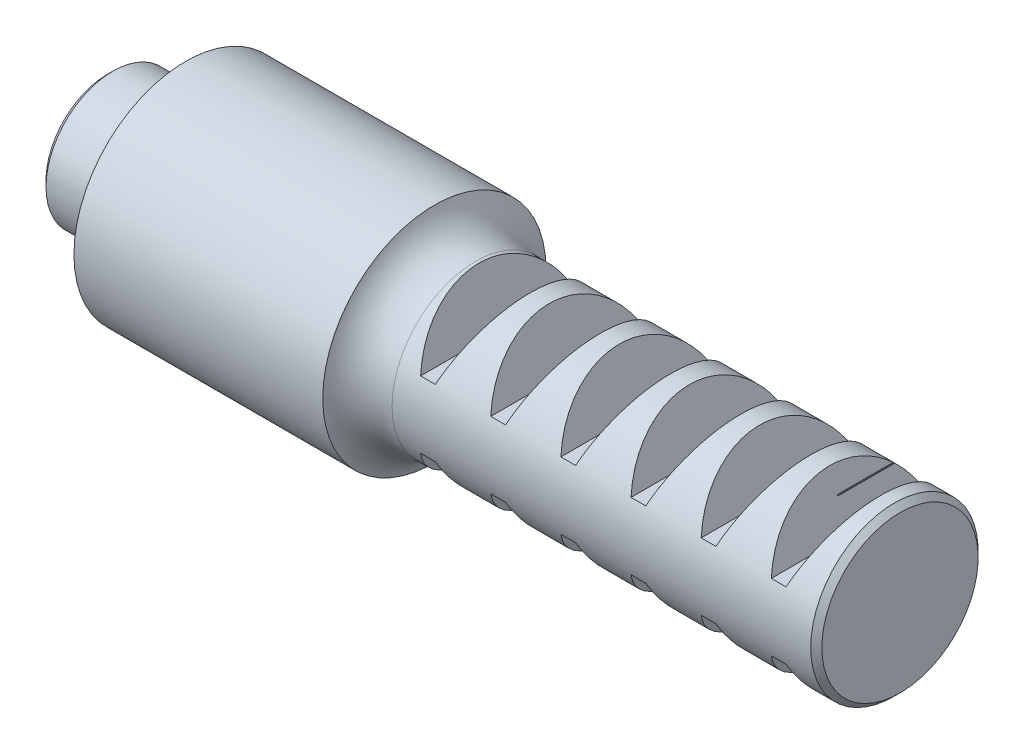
ISO-10303-21;
HEADER;
FILE_DESCRIPTION(('STEP AP214'),'2;1');
FILE_NAME('part.step','',(''),(''),'','','');
FILE_SCHEMA(('AUTOMOTIVE_DESIGN { 1 0 10303 214 1 1 1 1 }'));
ENDSEC;
DATA;
#1=APPLICATION_CONTEXT('core data for automotive mechanical design processes');
#2=APPLICATION_PROTOCOL_DEFINITION('international standard','automotive_design',2000,#1);
#3=PRODUCT_CONTEXT('',#1,'mechanical');
#4=PRODUCT('Part','Part','',(#3));
#5=PRODUCT_RELATED_PRODUCT_CATEGORY('part','',(#4));
#6=PRODUCT_DEFINITION_FORMATION('','',#4);
#7=PRODUCT_DEFINITION_CONTEXT('part definition',#1,'design');
#8=PRODUCT_DEFINITION('design','',#6,#7);
#9=PRODUCT_DEFINITION_SHAPE('','',#8);
#10=(LENGTH_UNIT() NAMED_UNIT(*) SI_UNIT(.MILLI.,.METRE.));
#11=(NAMED_UNIT(*) PLANE_ANGLE_UNIT() SI_UNIT($,.RADIAN.));
#12=(NAMED_UNIT(*) SI_UNIT($,.STERADIAN.) SOLID_ANGLE_UNIT());
#13=UNCERTAINTY_MEASURE_WITH_UNIT(LENGTH_MEASURE(1.E-05),#10,'distance_accuracy_value','');
#14=(GEOMETRIC_REPRESENTATION_CONTEXT(3) GLOBAL_UNCERTAINTY_ASSIGNED_CONTEXT((#13)) GLOBAL_UNIT_ASSIGNED_CONTEXT((#10,
#11,#12)) REPRESENTATION_CONTEXT('',''));
#15=CARTESIAN_POINT('',(0.,0.,0.));
#16=DIRECTION('',(0.,0.,1.));
#17=DIRECTION('',(1.,0.,0.));
#18=AXIS2_PLACEMENT_3D('',#15,#16,#17);
#19=CARTESIAN_POINT('',(0.,0.,0.));
#20=DIRECTION('',(-1.,0.,0.));
#21=DIRECTION('',(0.,0.,1.));
#22=AXIS2_PLACEMENT_3D('',#19,#20,#21);
#23=CYLINDRICAL_SURFACE('',#22,7.50000000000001);
#24=CARTESIAN_POINT('',(53.2923388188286,0.,0.));
#25=DIRECTION('',(-0.93969262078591,-0.342020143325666,0.));
#26=DIRECTION('',(-0.342020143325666,0.93969262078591,0.));
#27=AXIS2_PLACEMENT_3D('',#24,#25,#26);
#28=ELLIPSE('',#27,7.98133329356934,7.50000000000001);
#29=CARTESIAN_POINT('',(54.3842495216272,-3.,-6.87386354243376));
#30=VERTEX_POINT('',#29);
#31=CARTESIAN_POINT('',(54.3842495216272,-3.,6.87386354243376));
#32=VERTEX_POINT('',#31);
#33=EDGE_CURVE('E489',#30,#32,#28,.T.);
#34=ORIENTED_EDGE('',*,*,#33,.F.);
#35=DIRECTION('',(-1.,0.,0.));
#36=VECTOR('',#35,1.);
#37=CARTESIAN_POINT('',(0.,-3.,-6.87386354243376));
#38=LINE('',#37,#36);
#39=CARTESIAN_POINT('',(53.0625080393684,-3.,-6.87386354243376));
#40=VERTEX_POINT('',#39);
#41=EDGE_CURVE('E495',#40,#30,#38,.F.);
#42=ORIENTED_EDGE('',*,*,#41,.F.);
#43=CARTESIAN_POINT('',(54.154418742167,0.,0.));
#44=DIRECTION('',(0.939692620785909,-0.342020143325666,0.));
#45=DIRECTION('',(-0.342020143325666,-0.939692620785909,0.));
#46=AXIS2_PLACEMENT_3D('',#43,#44,#45);
#47=ELLIPSE('',#46,7.98133329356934,7.50000000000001);
#48=CARTESIAN_POINT('',(53.0625080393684,-3.,6.87386354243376));
#49=VERTEX_POINT('',#48);
#50=EDGE_CURVE('E493',#49,#40,#47,.T.);
#51=ORIENTED_EDGE('',*,*,#50,.F.);
#52=DIRECTION('',(-1.,0.,0.));
#53=VECTOR('',#52,1.);
#54=CARTESIAN_POINT('',(0.,-3.,6.87386354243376));
#55=LINE('',#54,#53);
#56=EDGE_CURVE('E491',#32,#49,#55,.T.);
#57=ORIENTED_EDGE('',*,*,#56,.F.);
#58=EDGE_LOOP('',(#34,#42,#51,#57));
#59=FACE_BOUND('',#58,.T.);
#60=CARTESIAN_POINT('',(47.009153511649,0.,0.));
#61=DIRECTION('',(-0.93969262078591,-0.342020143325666,0.));
#62=DIRECTION('',(-0.342020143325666,0.93969262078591,0.));
#63=AXIS2_PLACEMENT_3D('',#60,#61,#62);
#64=ELLIPSE('',#63,7.98133329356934,7.50000000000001);
#65=CARTESIAN_POINT('',(48.1010642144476,-3.,-6.87386354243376));
#66=VERTEX_POINT('',#65);
#67=CARTESIAN_POINT('',(48.1010642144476,-3.,6.87386354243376));
#68=VERTEX_POINT('',#67);
#69=EDGE_CURVE('E480',#66,#68,#64,.T.);
#70=ORIENTED_EDGE('',*,*,#69,.F.);
#71=DIRECTION('',(-1.,0.,0.));
#72=VECTOR('',#71,1.);
#73=CARTESIAN_POINT('',(0.,-3.,-6.87386354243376));
#74=LINE('',#73,#72);
#75=CARTESIAN_POINT('',(46.7793227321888,-3.,-6.87386354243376));
#76=VERTEX_POINT('',#75);
#77=EDGE_CURVE('E486',#76,#66,#74,.F.);
#78=ORIENTED_EDGE('',*,*,#77,.F.);
#79=CARTESIAN_POINT('',(47.8712334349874,0.,0.));
#80=DIRECTION('',(0.939692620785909,-0.342020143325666,0.));
#81=DIRECTION('',(-0.342020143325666,-0.939692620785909,0.));
#82=AXIS2_PLACEMENT_3D('',#79,#80,#81);
#83=ELLIPSE('',#82,7.98133329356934,7.50000000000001);
#84=CARTESIAN_POINT('',(46.7793227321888,-3.,6.87386354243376));
#85=VERTEX_POINT('',#84);
#86=EDGE_CURVE('E484',#85,#76,#83,.T.);
#87=ORIENTED_EDGE('',*,*,#86,.F.);
#88=DIRECTION('',(-1.,0.,0.));
#89=VECTOR('',#88,1.);
#90=CARTESIAN_POINT('',(0.,-3.,6.87386354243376));
#91=LINE('',#90,#89);
#92=EDGE_CURVE('E482',#68,#85,#91,.T.);
#93=ORIENTED_EDGE('',*,*,#92,.F.);
#94=EDGE_LOOP('',(#70,#78,#87,#93));
#95=FACE_BOUND('',#94,.T.);
#96=CARTESIAN_POINT('',(40.7259682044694,0.,0.));
#97=DIRECTION('',(-0.93969262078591,-0.342020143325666,0.));
#98=DIRECTION('',(-0.342020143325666,0.93969262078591,0.));
#99=AXIS2_PLACEMENT_3D('',#96,#97,#98);
#100=ELLIPSE('',#99,7.98133329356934,7.50000000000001);
#101=CARTESIAN_POINT('',(41.817878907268,-3.,-6.87386354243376));
#102=VERTEX_POINT('',#101);
#103=CARTESIAN_POINT('',(41.817878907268,-3.,6.87386354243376));
#104=VERTEX_POINT('',#103);
#105=EDGE_CURVE('E471',#102,#104,#100,.T.);
#106=ORIENTED_EDGE('',*,*,#105,.F.);
#107=DIRECTION('',(-1.,0.,0.));
#108=VECTOR('',#107,1.);
#109=CARTESIAN_POINT('',(0.,-3.,-6.87386354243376));
#110=LINE('',#109,#108);
#111=CARTESIAN_POINT('',(40.4961374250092,-3.,-6.87386354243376));
#112=VERTEX_POINT('',#111);
#113=EDGE_CURVE('E477',#112,#102,#110,.F.);
#114=ORIENTED_EDGE('',*,*,#113,.F.);
#115=CARTESIAN_POINT('',(41.5880481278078,0.,0.));
#116=DIRECTION('',(0.939692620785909,-0.342020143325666,0.));
#117=DIRECTION('',(-0.342020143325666,-0.939692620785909,0.));
#118=AXIS2_PLACEMENT_3D('',#115,#116,#117);
#119=ELLIPSE('',#118,7.98133329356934,7.50000000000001);
#120=CARTESIAN_POINT('',(40.4961374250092,-3.,6.87386354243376));
#121=VERTEX_POINT('',#120);
#122=EDGE_CURVE('E475',#121,#112,#119,.T.);
#123=ORIENTED_EDGE('',*,*,#122,.F.);
#124=DIRECTION('',(-1.,0.,0.));
#125=VECTOR('',#124,1.);
#126=CARTESIAN_POINT('',(0.,-3.,6.87386354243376));
#127=LINE('',#126,#125);
#128=EDGE_CURVE('E473',#104,#121,#127,.T.);
#129=ORIENTED_EDGE('',*,*,#128,.F.);
#130=EDGE_LOOP('',(#106,#114,#123,#129));
#131=FACE_BOUND('',#130,.T.);
#132=CARTESIAN_POINT('',(34.4427828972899,0.,0.));
#133=DIRECTION('',(-0.93969262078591,-0.342020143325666,0.));
#134=DIRECTION('',(-0.342020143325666,0.93969262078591,0.));
#135=AXIS2_PLACEMENT_3D('',#132,#133,#134);
#136=ELLIPSE('',#135,7.98133329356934,7.50000000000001);
#137=CARTESIAN_POINT('',(35.5346936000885,-3.,-6.87386354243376));
#138=VERTEX_POINT('',#137);
#139=CARTESIAN_POINT('',(35.5346936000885,-3.,6.87386354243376));
#140=VERTEX_POINT('',#139);
#141=EDGE_CURVE('E462',#138,#140,#136,.T.);
#142=ORIENTED_EDGE('',*,*,#141,.F.);
#143=DIRECTION('',(-1.,0.,0.));
#144=VECTOR('',#143,1.);
#145=CARTESIAN_POINT('',(0.,-3.,-6.87386354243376));
#146=LINE('',#145,#144);
#147=CARTESIAN_POINT('',(34.2129521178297,-3.,-6.87386354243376));
#148=VERTEX_POINT('',#147);
#149=EDGE_CURVE('E468',#148,#138,#146,.F.);
#150=ORIENTED_EDGE('',*,*,#149,.F.);
#151=CARTESIAN_POINT('',(35.3048628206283,0.,0.));
#152=DIRECTION('',(0.939692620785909,-0.342020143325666,0.));
#153=DIRECTION('',(-0.342020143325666,-0.939692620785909,0.));
#154=AXIS2_PLACEMENT_3D('',#151,#152,#153);
#155=ELLIPSE('',#154,7.98133329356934,7.50000000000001);
#156=CARTESIAN_POINT('',(34.2129521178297,-3.,6.87386354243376));
#157=VERTEX_POINT('',#156);
#158=EDGE_CURVE('E466',#157,#148,#155,.T.);
#159=ORIENTED_EDGE('',*,*,#158,.F.);
#160=DIRECTION('',(-1.,0.,0.));
#161=VECTOR('',#160,1.);
#162=CARTESIAN_POINT('',(0.,-3.,6.87386354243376));
#163=LINE('',#162,#161);
#164=EDGE_CURVE('E464',#140,#157,#163,.T.);
#165=ORIENTED_EDGE('',*,*,#164,.F.);
#166=EDGE_LOOP('',(#142,#150,#159,#165));
#167=FACE_BOUND('',#166,.T.);
#168=CARTESIAN_POINT('',(28.1595975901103,0.,0.));
#169=DIRECTION('',(-0.93969262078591,-0.342020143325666,0.));
#170=DIRECTION('',(-0.342020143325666,0.93969262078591,0.));
#171=AXIS2_PLACEMENT_3D('',#168,#169,#170);
#172=ELLIPSE('',#171,7.98133329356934,7.50000000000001);
#173=CARTESIAN_POINT('',(29.2515082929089,-3.,-6.87386354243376));
#174=VERTEX_POINT('',#173);
#175=CARTESIAN_POINT('',(29.2515082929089,-3.,6.87386354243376));
#176=VERTEX_POINT('',#175);
#177=EDGE_CURVE('E453',#174,#176,#172,.T.);
#178=ORIENTED_EDGE('',*,*,#177,.F.);
#179=DIRECTION('',(-1.,0.,0.));
#180=VECTOR('',#179,1.);
#181=CARTESIAN_POINT('',(0.,-3.,-6.87386354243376));
#182=LINE('',#181,#180);
#183=CARTESIAN_POINT('',(27.9297668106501,-3.,-6.87386354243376));
#184=VERTEX_POINT('',#183);
#185=EDGE_CURVE('E459',#184,#174,#182,.F.);
#186=ORIENTED_EDGE('',*,*,#185,.F.);
#187=CARTESIAN_POINT('',(29.0216775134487,0.,0.));
#188=DIRECTION('',(0.939692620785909,-0.342020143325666,0.));
#189=DIRECTION('',(-0.342020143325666,-0.939692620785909,0.));
#190=AXIS2_PLACEMENT_3D('',#187,#188,#189);
#191=ELLIPSE('',#190,7.98133329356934,7.50000000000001);
#192=CARTESIAN_POINT('',(27.9297668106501,-3.,6.87386354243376));
#193=VERTEX_POINT('',#192);
#194=EDGE_CURVE('E457',#193,#184,#191,.T.);
#195=ORIENTED_EDGE('',*,*,#194,.F.);
#196=DIRECTION('',(-1.,0.,0.));
#197=VECTOR('',#196,1.);
#198=CARTESIAN_POINT('',(0.,-3.,6.87386354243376));
#199=LINE('',#198,#197);
#200=EDGE_CURVE('E455',#176,#193,#199,.T.);
#201=ORIENTED_EDGE('',*,*,#200,.F.);
#202=EDGE_LOOP('',(#178,#186,#195,#201));
#203=FACE_BOUND('',#202,.T.);
#204=CARTESIAN_POINT('',(26.,0.,0.));
#205=DIRECTION('',(-1.,0.,0.));
#206=DIRECTION('',(0.,0.,1.));
#207=AXIS2_PLACEMENT_3D('',#204,#205,#206);
#208=CIRCLE('',#207,7.50000000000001);
#209=CARTESIAN_POINT('',(26.,0.,7.50000000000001));
#210=VERTEX_POINT('',#209);
#211=EDGE_CURVE('E371',#210,#210,#208,.T.);
#212=ORIENTED_EDGE('',*,*,#211,.F.);
#213=EDGE_LOOP('',(#212));
#214=FACE_BOUND('',#213,.T.);
#215=CARTESIAN_POINT('',(63.5,0.,0.));
#216=DIRECTION('',(-1.,0.,0.));
#217=DIRECTION('',(0.,0.,1.));
#218=AXIS2_PLACEMENT_3D('',#215,#216,#217);
#219=CIRCLE('',#218,7.50000000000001);
#220=CARTESIAN_POINT('',(63.5,0.,7.50000000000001));
#221=VERTEX_POINT('',#220);
#222=EDGE_CURVE('E385',#221,#221,#219,.T.);
#223=ORIENTED_EDGE('',*,*,#222,.T.);
#224=EDGE_LOOP('',(#223));
#225=FACE_BOUND('',#224,.T.);
#226=CARTESIAN_POINT('',(28.1595975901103,0.,0.));
#227=DIRECTION('',(0.93969262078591,-0.342020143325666,0.));
#228=DIRECTION('',(-0.342020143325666,-0.93969262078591,0.));
#229=AXIS2_PLACEMENT_3D('',#226,#227,#228);
#230=ELLIPSE('',#229,7.98133329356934,7.50000000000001);
#231=CARTESIAN_POINT('',(29.2515082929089,3.,-6.87386354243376));
#232=VERTEX_POINT('',#231);
#233=CARTESIAN_POINT('',(29.2515082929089,3.,6.87386354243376));
#234=VERTEX_POINT('',#233);
#235=EDGE_CURVE('E394',#232,#234,#230,.T.);
#236=ORIENTED_EDGE('',*,*,#235,.T.);
#237=DIRECTION('',(-1.,0.,0.));
#238=VECTOR('',#237,1.);
#239=CARTESIAN_POINT('',(0.,3.,6.87386354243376));
#240=LINE('',#239,#238);
#241=CARTESIAN_POINT('',(27.9297668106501,3.,6.87386354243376));
#242=VERTEX_POINT('',#241);
#243=EDGE_CURVE('E398',#234,#242,#240,.T.);
#244=ORIENTED_EDGE('',*,*,#243,.T.);
#245=CARTESIAN_POINT('',(29.0216775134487,0.,0.));
#246=DIRECTION('',(-0.939692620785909,-0.342020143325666,0.));
#247=DIRECTION('',(-0.342020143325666,0.939692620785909,0.));
#248=AXIS2_PLACEMENT_3D('',#245,#246,#247);
#249=ELLIPSE('',#248,7.98133329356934,7.50000000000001);
#250=CARTESIAN_POINT('',(27.9297668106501,3.,-6.87386354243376));
#251=VERTEX_POINT('',#250);
#252=EDGE_CURVE('E396',#242,#251,#249,.T.);
#253=ORIENTED_EDGE('',*,*,#252,.T.);
#254=DIRECTION('',(-1.,0.,0.));
#255=VECTOR('',#254,1.);
#256=CARTESIAN_POINT('',(0.,3.,-6.87386354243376));
#257=LINE('',#256,#255);
#258=EDGE_CURVE('E391',#251,#232,#257,.F.);
#259=ORIENTED_EDGE('',*,*,#258,.T.);
#260=EDGE_LOOP('',(#236,#244,#253,#259));
#261=FACE_BOUND('',#260,.T.);
#262=CARTESIAN_POINT('',(34.4427828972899,0.,0.));
#263=DIRECTION('',(0.93969262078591,-0.342020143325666,0.));
#264=DIRECTION('',(-0.342020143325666,-0.93969262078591,0.));
#265=AXIS2_PLACEMENT_3D('',#262,#263,#264);
#266=ELLIPSE('',#265,7.98133329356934,7.50000000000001);
#267=CARTESIAN_POINT('',(35.5346936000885,3.,-6.87386354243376));
#268=VERTEX_POINT('',#267);
#269=CARTESIAN_POINT('',(35.5346936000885,3.,6.87386354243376));
#270=VERTEX_POINT('',#269);
#271=EDGE_CURVE('E404',#268,#270,#266,.T.);
#272=ORIENTED_EDGE('',*,*,#271,.T.);
#273=DIRECTION('',(-1.,0.,0.));
#274=VECTOR('',#273,1.);
#275=CARTESIAN_POINT('',(0.,3.,6.87386354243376));
#276=LINE('',#275,#274);
#277=CARTESIAN_POINT('',(34.2129521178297,3.,6.87386354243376));
#278=VERTEX_POINT('',#277);
#279=EDGE_CURVE('E408',#270,#278,#276,.T.);
#280=ORIENTED_EDGE('',*,*,#279,.T.);
#281=CARTESIAN_POINT('',(35.3048628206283,0.,0.));
#282=DIRECTION('',(-0.939692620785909,-0.342020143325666,0.));
#283=DIRECTION('',(-0.342020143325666,0.939692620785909,0.));
#284=AXIS2_PLACEMENT_3D('',#281,#282,#283);
#285=ELLIPSE('',#284,7.98133329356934,7.50000000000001);
#286=CARTESIAN_POINT('',(34.2129521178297,3.,-6.87386354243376));
#287=VERTEX_POINT('',#286);
#288=EDGE_CURVE('E406',#278,#287,#285,.T.);
#289=ORIENTED_EDGE('',*,*,#288,.T.);
#290=DIRECTION('',(-1.,0.,0.));
#291=VECTOR('',#290,1.);
#292=CARTESIAN_POINT('',(0.,3.,-6.87386354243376));
#293=LINE('',#292,#291);
#294=EDGE_CURVE('E401',#287,#268,#293,.F.);
#295=ORIENTED_EDGE('',*,*,#294,.T.);
#296=EDGE_LOOP('',(#272,#280,#289,#295));
#297=FACE_BOUND('',#296,.T.);
#298=CARTESIAN_POINT('',(40.7259682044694,0.,0.));
#299=DIRECTION('',(0.93969262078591,-0.342020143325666,0.));
#300=DIRECTION('',(-0.342020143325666,-0.93969262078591,0.));
#301=AXIS2_PLACEMENT_3D('',#298,#299,#300);
#302=ELLIPSE('',#301,7.98133329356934,7.50000000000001);
#303=CARTESIAN_POINT('',(41.817878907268,3.,-6.87386354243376));
#304=VERTEX_POINT('',#303);
#305=CARTESIAN_POINT('',(41.817878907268,3.,6.87386354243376));
#306=VERTEX_POINT('',#305);
#307=EDGE_CURVE('E414',#304,#306,#302,.T.);
#308=ORIENTED_EDGE('',*,*,#307,.T.);
#309=DIRECTION('',(-1.,0.,0.));
#310=VECTOR('',#309,1.);
#311=CARTESIAN_POINT('',(0.,3.,6.87386354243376));
#312=LINE('',#311,#310);
#313=CARTESIAN_POINT('',(40.4961374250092,3.,6.87386354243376));
#314=VERTEX_POINT('',#313);
#315=EDGE_CURVE('E418',#306,#314,#312,.T.);
#316=ORIENTED_EDGE('',*,*,#315,.T.);
#317=CARTESIAN_POINT('',(41.5880481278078,0.,0.));
#318=DIRECTION('',(-0.939692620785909,-0.342020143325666,0.));
#319=DIRECTION('',(-0.342020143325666,0.939692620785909,0.));
#320=AXIS2_PLACEMENT_3D('',#317,#318,#319);
#321=ELLIPSE('',#320,7.98133329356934,7.50000000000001);
#322=CARTESIAN_POINT('',(40.4961374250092,3.,-6.87386354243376));
#323=VERTEX_POINT('',#322);
#324=EDGE_CURVE('E416',#314,#323,#321,.T.);
#325=ORIENTED_EDGE('',*,*,#324,.T.);
#326=DIRECTION('',(-1.,0.,0.));
#327=VECTOR('',#326,1.);
#328=CARTESIAN_POINT('',(0.,3.,-6.87386354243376));
#329=LINE('',#328,#327);
#330=EDGE_CURVE('E411',#323,#304,#329,.F.);
#331=ORIENTED_EDGE('',*,*,#330,.T.);
#332=EDGE_LOOP('',(#308,#316,#325,#331));
#333=FACE_BOUND('',#332,.T.);
#334=CARTESIAN_POINT('',(47.009153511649,0.,0.));
#335=DIRECTION('',(0.93969262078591,-0.342020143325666,0.));
#336=DIRECTION('',(-0.342020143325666,-0.93969262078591,0.));
#337=AXIS2_PLACEMENT_3D('',#334,#335,#336);
#338=ELLIPSE('',#337,7.98133329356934,7.50000000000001);
#339=CARTESIAN_POINT('',(48.1010642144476,3.,-6.87386354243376));
#340=VERTEX_POINT('',#339);
#341=CARTESIAN_POINT('',(48.1010642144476,3.,6.87386354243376));
#342=VERTEX_POINT('',#341);
#343=EDGE_CURVE('E424',#340,#342,#338,.T.);
#344=ORIENTED_EDGE('',*,*,#343,.T.);
#345=DIRECTION('',(-1.,0.,0.));
#346=VECTOR('',#345,1.);
#347=CARTESIAN_POINT('',(0.,3.,6.87386354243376));
#348=LINE('',#347,#346);
#349=CARTESIAN_POINT('',(46.7793227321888,3.,6.87386354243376));
#350=VERTEX_POINT('',#349);
#351=EDGE_CURVE('E428',#342,#350,#348,.T.);
#352=ORIENTED_EDGE('',*,*,#351,.T.);
#353=CARTESIAN_POINT('',(47.8712334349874,0.,0.));
#354=DIRECTION('',(-0.939692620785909,-0.342020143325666,0.));
#355=DIRECTION('',(-0.342020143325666,0.939692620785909,0.));
#356=AXIS2_PLACEMENT_3D('',#353,#354,#355);
#357=ELLIPSE('',#356,7.98133329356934,7.50000000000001);
#358=CARTESIAN_POINT('',(46.7793227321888,3.,-6.87386354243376));
#359=VERTEX_POINT('',#358);
#360=EDGE_CURVE('E426',#350,#359,#357,.T.);
#361=ORIENTED_EDGE('',*,*,#360,.T.);
#362=DIRECTION('',(-1.,0.,0.));
#363=VECTOR('',#362,1.);
#364=CARTESIAN_POINT('',(0.,3.,-6.87386354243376));
#365=LINE('',#364,#363);
#366=EDGE_CURVE('E421',#359,#340,#365,.F.);
#367=ORIENTED_EDGE('',*,*,#366,.T.);
#368=EDGE_LOOP('',(#344,#352,#361,#367));
#369=FACE_BOUND('',#368,.T.);
#370=CARTESIAN_POINT('',(53.2923388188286,0.,0.));
#371=DIRECTION('',(0.93969262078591,-0.342020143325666,0.));
#372=DIRECTION('',(-0.342020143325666,-0.93969262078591,0.));
#373=AXIS2_PLACEMENT_3D('',#370,#371,#372);
#374=ELLIPSE('',#373,7.98133329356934,7.50000000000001);
#375=CARTESIAN_POINT('',(54.3842495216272,3.,-6.87386354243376));
#376=VERTEX_POINT('',#375);
#377=CARTESIAN_POINT('',(54.3842495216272,3.,6.87386354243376));
#378=VERTEX_POINT('',#377);
#379=EDGE_CURVE('E434',#376,#378,#374,.T.);
#380=ORIENTED_EDGE('',*,*,#379,.T.);
#381=DIRECTION('',(-1.,0.,0.));
#382=VECTOR('',#381,1.);
#383=CARTESIAN_POINT('',(0.,3.,6.87386354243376));
#384=LINE('',#383,#382);
#385=CARTESIAN_POINT('',(53.0625080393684,3.,6.87386354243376));
#386=VERTEX_POINT('',#385);
#387=EDGE_CURVE('E438',#378,#386,#384,.T.);
#388=ORIENTED_EDGE('',*,*,#387,.T.);
#389=CARTESIAN_POINT('',(54.154418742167,0.,0.));
#390=DIRECTION('',(-0.939692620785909,-0.342020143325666,0.));
#391=DIRECTION('',(-0.342020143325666,0.939692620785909,0.));
#392=AXIS2_PLACEMENT_3D('',#389,#390,#391);
#393=ELLIPSE('',#392,7.98133329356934,7.50000000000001);
#394=CARTESIAN_POINT('',(53.0625080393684,3.,-6.87386354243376));
#395=VERTEX_POINT('',#394);
#396=EDGE_CURVE('E436',#386,#395,#393,.T.);
#397=ORIENTED_EDGE('',*,*,#396,.T.);
#398=DIRECTION('',(-1.,0.,0.));
#399=VECTOR('',#398,1.);
#400=CARTESIAN_POINT('',(0.,3.,-6.87386354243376));
#401=LINE('',#400,#399);
#402=EDGE_CURVE('E431',#395,#376,#401,.F.);
#403=ORIENTED_EDGE('',*,*,#402,.T.);
#404=EDGE_LOOP('',(#380,#388,#397,#403));
#405=FACE_BOUND('',#404,.T.);
#406=CARTESIAN_POINT('',(60.4376040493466,0.,0.));
#407=DIRECTION('',(-0.939692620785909,-0.342020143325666,0.));
#408=DIRECTION('',(-0.342020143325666,0.939692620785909,0.));
#409=AXIS2_PLACEMENT_3D('',#406,#407,#408);
#410=ELLIPSE('',#409,7.98133329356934,7.50000000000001);
#411=CARTESIAN_POINT('',(59.345693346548,3.,6.87386354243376));
#412=VERTEX_POINT('',#411);
#413=CARTESIAN_POINT('',(58.4,5.59827111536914,-4.99092782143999));
#414=VERTEX_POINT('',#413);
#415=EDGE_CURVE('E447',#412,#414,#410,.T.);
#416=ORIENTED_EDGE('',*,*,#415,.T.);
#417=CARTESIAN_POINT('',(58.4,0.,0.));
#418=DIRECTION('',(-1.,0.,0.));
#419=DIRECTION('',(0.,0.,1.));
#420=AXIS2_PLACEMENT_3D('',#417,#418,#419);
#421=CIRCLE('',#420,7.50000000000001);
#422=CARTESIAN_POINT('',(58.4,5.50000000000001,-5.09901951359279));
#423=VERTEX_POINT('',#422);
#424=EDGE_CURVE('E581',#414,#423,#421,.T.);
#425=ORIENTED_EDGE('',*,*,#424,.T.);
#426=DIRECTION('',(-1.,0.,0.));
#427=VECTOR('',#426,1.);
#428=CARTESIAN_POINT('',(0.,5.50000000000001,-5.09901951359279));
#429=LINE('',#428,#427);
#430=CARTESIAN_POINT('',(58.4357677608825,5.50000000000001,-5.09901951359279));
#431=VERTEX_POINT('',#430);
#432=EDGE_CURVE('E592',#423,#431,#429,.F.);
#433=ORIENTED_EDGE('',*,*,#432,.T.);
#434=CARTESIAN_POINT('',(59.345693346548,3.,-6.87386354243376));
#435=VERTEX_POINT('',#434);
#436=EDGE_CURVE('E446',#431,#435,#410,.T.);
#437=ORIENTED_EDGE('',*,*,#436,.T.);
#438=DIRECTION('',(-1.,0.,0.));
#439=VECTOR('',#438,1.);
#440=CARTESIAN_POINT('',(0.,3.,-6.87386354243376));
#441=LINE('',#440,#439);
#442=CARTESIAN_POINT('',(60.6674348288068,3.,-6.87386354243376));
#443=VERTEX_POINT('',#442);
#444=EDGE_CURVE('E441',#435,#443,#441,.F.);
#445=ORIENTED_EDGE('',*,*,#444,.T.);
#446=CARTESIAN_POINT('',(59.5755241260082,0.,0.));
#447=DIRECTION('',(0.93969262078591,-0.342020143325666,0.));
#448=DIRECTION('',(-0.342020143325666,-0.93969262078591,0.));
#449=AXIS2_PLACEMENT_3D('',#446,#447,#448);
#450=ELLIPSE('',#449,7.98133329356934,7.50000000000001);
#451=CARTESIAN_POINT('',(60.6674348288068,3.,6.87386354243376));
#452=VERTEX_POINT('',#451);
#453=EDGE_CURVE('E444',#443,#452,#450,.T.);
#454=ORIENTED_EDGE('',*,*,#453,.T.);
#455=DIRECTION('',(-1.,0.,0.));
#456=VECTOR('',#455,1.);
#457=CARTESIAN_POINT('',(0.,3.,6.87386354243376));
#458=LINE('',#457,#456);
#459=EDGE_CURVE('E450',#452,#412,#458,.T.);
#460=ORIENTED_EDGE('',*,*,#459,.T.);
#461=EDGE_LOOP('',(#416,#425,#433,#437,#445,#454,#460));
#462=FACE_BOUND('',#461,.T.);
#463=CARTESIAN_POINT('',(58.4,0.,0.));
#464=DIRECTION('',(1.,0.,0.));
#465=DIRECTION('',(0.,0.,-1.));
#466=AXIS2_PLACEMENT_3D('',#463,#464,#465);
#467=CIRCLE('',#466,7.50000000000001);
#468=CARTESIAN_POINT('',(58.4,-5.59827111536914,-4.99092782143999));
#469=VERTEX_POINT('',#468);
#470=CARTESIAN_POINT('',(58.4,-5.50000000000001,-5.09901951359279));
#471=VERTEX_POINT('',#470);
#472=EDGE_CURVE('E744',#469,#471,#467,.T.);
#473=ORIENTED_EDGE('',*,*,#472,.F.);
#474=CARTESIAN_POINT('',(60.4376040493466,0.,0.));
#475=DIRECTION('',(0.939692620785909,-0.342020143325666,0.));
#476=DIRECTION('',(-0.342020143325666,-0.939692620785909,0.));
#477=AXIS2_PLACEMENT_3D('',#474,#475,#476);
#478=ELLIPSE('',#477,7.98133329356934,7.50000000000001);
#479=CARTESIAN_POINT('',(59.345693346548,-3.,6.87386354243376));
#480=VERTEX_POINT('',#479);
#481=EDGE_CURVE('E262',#480,#469,#478,.T.);
#482=ORIENTED_EDGE('',*,*,#481,.F.);
#483=DIRECTION('',(-1.,0.,0.));
#484=VECTOR('',#483,1.);
#485=CARTESIAN_POINT('',(0.,-3.,6.87386354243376));
#486=LINE('',#485,#484);
#487=CARTESIAN_POINT('',(60.6674348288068,-3.,6.87386354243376));
#488=VERTEX_POINT('',#487);
#489=EDGE_CURVE('E273',#488,#480,#486,.T.);
#490=ORIENTED_EDGE('',*,*,#489,.F.);
#491=CARTESIAN_POINT('',(59.5755241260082,0.,0.));
#492=DIRECTION('',(-0.93969262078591,-0.342020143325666,0.));
#493=DIRECTION('',(-0.342020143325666,0.93969262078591,0.));
#494=AXIS2_PLACEMENT_3D('',#491,#492,#493);
#495=ELLIPSE('',#494,7.98133329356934,7.50000000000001);
#496=CARTESIAN_POINT('',(60.6674348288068,-3.,-6.87386354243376));
#497=VERTEX_POINT('',#496);
#498=EDGE_CURVE('E292',#497,#488,#495,.T.);
#499=ORIENTED_EDGE('',*,*,#498,.F.);
#500=DIRECTION('',(-1.,0.,0.));
#501=VECTOR('',#500,1.);
#502=CARTESIAN_POINT('',(0.,-3.,-6.87386354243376));
#503=LINE('',#502,#501);
#504=CARTESIAN_POINT('',(59.345693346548,-3.,-6.87386354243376));
#505=VERTEX_POINT('',#504);
#506=EDGE_CURVE('E267',#505,#497,#503,.F.);
#507=ORIENTED_EDGE('',*,*,#506,.F.);
#508=CARTESIAN_POINT('',(58.4357677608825,-5.50000000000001,-5.09901951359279));
#509=VERTEX_POINT('',#508);
#510=EDGE_CURVE('E268',#509,#505,#478,.T.);
#511=ORIENTED_EDGE('',*,*,#510,.F.);
#512=DIRECTION('',(-1.,0.,0.));
#513=VECTOR('',#512,1.);
#514=CARTESIAN_POINT('',(0.,-5.50000000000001,-5.09901951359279));
#515=LINE('',#514,#513);
#516=EDGE_CURVE('E291',#471,#509,#515,.F.);
#517=ORIENTED_EDGE('',*,*,#516,.F.);
#518=EDGE_LOOP('',(#473,#482,#490,#499,#507,#511,#517));
#519=FACE_BOUND('',#518,.T.);
#520=ADVANCED_FACE('F44',(#59,#95,#131,#167,#203,#214,#225,#261,#297,#333,#369,#405,#462,#519),
#23,.T.);
#521=CARTESIAN_POINT('',(59.345693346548,-3.,-10.));
#522=DIRECTION('',(0.939692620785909,-0.342020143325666,0.));
#523=DIRECTION('',(0.342020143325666,0.939692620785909,0.));
#524=AXIS2_PLACEMENT_3D('',#521,#522,#523);
#525=PLANE('',#524);
#526=ORIENTED_EDGE('',*,*,#481,.T.);
#527=DIRECTION('',(0.,0.,1.));
#528=VECTOR('',#527,1.);
#529=CARTESIAN_POINT('',(58.4,-5.59827111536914,-10.));
#530=LINE('',#529,#528);
#531=CARTESIAN_POINT('',(58.4,-5.59827111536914,0.));
#532=VERTEX_POINT('',#531);
#533=EDGE_CURVE('E11',#469,#532,#530,.T.);
#534=ORIENTED_EDGE('',*,*,#533,.T.);
#535=DIRECTION('',(-0.342020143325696,-0.939692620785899,0.));
#536=VECTOR('',#535,1.);
#537=CARTESIAN_POINT('',(58.4,-5.59827111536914,0.));
#538=LINE('',#537,#536);
#539=CARTESIAN_POINT('',(58.4357677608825,-5.50000000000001,0.));
#540=VERTEX_POINT('',#539);
#541=EDGE_CURVE('E245',#540,#532,#538,.T.);
#542=ORIENTED_EDGE('',*,*,#541,.F.);
#543=DIRECTION('',(0.,0.,-1.));
#544=VECTOR('',#543,1.);
#545=CARTESIAN_POINT('',(58.4357677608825,-5.50000000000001,-10.));
#546=LINE('',#545,#544);
#547=EDGE_CURVE('E52',#540,#509,#546,.T.);
#548=ORIENTED_EDGE('',*,*,#547,.T.);
#549=ORIENTED_EDGE('',*,*,#510,.T.);
#550=DIRECTION('',(0.,0.,1.));
#551=VECTOR('',#550,1.);
#552=CARTESIAN_POINT('',(59.345693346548,-3.,-10.));
#553=LINE('',#552,#551);
#554=EDGE_CURVE('E264',#505,#480,#553,.T.);
#555=ORIENTED_EDGE('',*,*,#554,.T.);
#556=EDGE_LOOP('',(#526,#534,#542,#548,#549,#555));
#557=FACE_BOUND('',#556,.T.);
#558=ADVANCED_FACE('F259',(#557),#525,.T.);
#559=CARTESIAN_POINT('',(-7.00000000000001,0.,0.));
#560=DIRECTION('',(1.,0.,0.));
#561=DIRECTION('',(0.,0.,-1.));
#562=AXIS2_PLACEMENT_3D('',#559,#560,#561);
#563=PLANE('',#562);
#564=CARTESIAN_POINT('',(-7.00000000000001,0.,0.));
#565=DIRECTION('',(-1.,0.,0.));
#566=DIRECTION('',(0.,0.,1.));
#567=AXIS2_PLACEMENT_3D('',#564,#565,#566);
#568=CIRCLE('',#567,2.49999999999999);
#569=CARTESIAN_POINT('',(-7.00000000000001,0.,2.49999999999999));
#570=VERTEX_POINT('',#569);
#571=EDGE_CURVE('E305',#570,#570,#568,.T.);
#572=ORIENTED_EDGE('',*,*,#571,.F.);
#573=EDGE_LOOP('',(#572));
#574=FACE_BOUND('',#573,.T.);
#575=CARTESIAN_POINT('',(-7.00000000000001,0.,0.));
#576=DIRECTION('',(1.,0.,0.));
#577=DIRECTION('',(0.,0.,-1.));
#578=AXIS2_PLACEMENT_3D('',#575,#576,#577);
#579=CIRCLE('',#578,5.49999999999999);
#580=CARTESIAN_POINT('',(-7.00000000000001,0.,-5.49999999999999));
#581=VERTEX_POINT('',#580);
#582=EDGE_CURVE('E271',#581,#581,#579,.F.);
#583=ORIENTED_EDGE('',*,*,#582,.T.);
#584=EDGE_LOOP('',(#583));
#585=FACE_BOUND('',#584,.T.);
#586=ADVANCED_FACE('F46',(#574,#585),#563,.F.);
#587=CARTESIAN_POINT('',(0.,0.,0.));
#588=DIRECTION('',(-1.,0.,0.));
#589=DIRECTION('',(0.,0.,1.));
#590=AXIS2_PLACEMENT_3D('',#587,#588,#589);
#591=CYLINDRICAL_SURFACE('',#590,6.);
#592=CARTESIAN_POINT('',(-6.5,0.,0.));
#593=DIRECTION('',(1.,0.,0.));
#594=DIRECTION('',(0.,0.,-1.));
#595=AXIS2_PLACEMENT_3D('',#592,#593,#594);
#596=CIRCLE('',#595,6.);
#597=CARTESIAN_POINT('',(-6.5,0.,-6.));
#598=VERTEX_POINT('',#597);
#599=EDGE_CURVE('E279',#598,#598,#596,.T.);
#600=ORIENTED_EDGE('',*,*,#599,.T.);
#601=EDGE_LOOP('',(#600));
#602=FACE_BOUND('',#601,.T.);
#603=CARTESIAN_POINT('',(0.,0.,0.));
#604=DIRECTION('',(-1.,0.,0.));
#605=DIRECTION('',(0.,0.,1.));
#606=AXIS2_PLACEMENT_3D('',#603,#604,#605);
#607=CIRCLE('',#606,6.);
#608=CARTESIAN_POINT('',(0.,0.,6.));
#609=VERTEX_POINT('',#608);
#610=EDGE_CURVE('E382',#609,#609,#607,.T.);
#611=ORIENTED_EDGE('',*,*,#610,.T.);
#612=EDGE_LOOP('',(#611));
#613=FACE_BOUND('',#612,.T.);
#614=ADVANCED_FACE('F543',(#602,#613),#591,.T.);
#615=CARTESIAN_POINT('',(0.,10.,0.));
#616=DIRECTION('',(1.,0.,0.));
#617=DIRECTION('',(0.,0.,-1.));
#618=AXIS2_PLACEMENT_3D('',#615,#616,#617);
#619=PLANE('',#618);
#620=ORIENTED_EDGE('',*,*,#610,.F.);
#621=EDGE_LOOP('',(#620));
#622=FACE_BOUND('',#621,.T.);
#623=CARTESIAN_POINT('',(0.,0.,0.));
#624=DIRECTION('',(-1.,0.,0.));
#625=DIRECTION('',(0.,0.,1.));
#626=AXIS2_PLACEMENT_3D('',#623,#624,#625);
#627=CIRCLE('',#626,10.);
#628=CARTESIAN_POINT('',(0.,0.,10.));
#629=VERTEX_POINT('',#628);
#630=EDGE_CURVE('E379',#629,#629,#627,.T.);
#631=ORIENTED_EDGE('',*,*,#630,.T.);
#632=EDGE_LOOP('',(#631));
#633=FACE_BOUND('',#632,.T.);
#634=ADVANCED_FACE('F540',(#622,#633),#619,.F.);
#635=CARTESIAN_POINT('',(0.,0.,0.));
#636=DIRECTION('',(-1.,0.,0.));
#637=DIRECTION('',(0.,0.,1.));
#638=AXIS2_PLACEMENT_3D('',#635,#636,#637);
#639=CYLINDRICAL_SURFACE('',#638,10.);
#640=ORIENTED_EDGE('',*,*,#630,.F.);
#641=EDGE_LOOP('',(#640));
#642=FACE_BOUND('',#641,.T.);
#643=CARTESIAN_POINT('',(22.2919007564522,0.,0.));
#644=DIRECTION('',(-1.,0.,0.));
#645=DIRECTION('',(0.,0.,1.));
#646=AXIS2_PLACEMENT_3D('',#643,#644,#645);
#647=CIRCLE('',#646,10.);
#648=CARTESIAN_POINT('',(22.2919007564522,0.,10.));
#649=VERTEX_POINT('',#648);
#650=EDGE_CURVE('E376',#649,#649,#647,.T.);
#651=ORIENTED_EDGE('',*,*,#650,.T.);
#652=EDGE_LOOP('',(#651));
#653=FACE_BOUND('',#652,.T.);
#654=ADVANCED_FACE('F536',(#642,#653),#639,.T.);
#655=CARTESIAN_POINT('',(26.,0.,0.));
#656=DIRECTION('',(-1.,0.,0.));
#657=DIRECTION('',(0.,0.,1.));
#658=AXIS2_PLACEMENT_3D('',#655,#656,#657);
#659=TOROIDAL_SURFACE('',#658,11.5,4.);
#660=ORIENTED_EDGE('',*,*,#650,.F.);
#661=EDGE_LOOP('',(#660));
#662=FACE_BOUND('',#661,.T.);
#663=ORIENTED_EDGE('',*,*,#211,.T.);
#664=EDGE_LOOP('',(#663));
#665=FACE_BOUND('',#664,.T.);
#666=ADVANCED_FACE('F533',(#662,#665),#659,.F.);
#667=CARTESIAN_POINT('',(64.,7.50000000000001,0.));
#668=DIRECTION('',(-1.,0.,0.));
#669=DIRECTION('',(0.,0.,1.));
#670=AXIS2_PLACEMENT_3D('',#667,#668,#669);
#671=PLANE('',#670);
#672=CARTESIAN_POINT('',(64.,0.,0.));
#673=DIRECTION('',(-1.,0.,0.));
#674=DIRECTION('',(0.,0.,1.));
#675=AXIS2_PLACEMENT_3D('',#672,#673,#674);
#676=CIRCLE('',#675,7.);
#677=CARTESIAN_POINT('',(64.,0.,7.));
#678=VERTEX_POINT('',#677);
#679=EDGE_CURVE('E388',#678,#678,#676,.F.);
#680=ORIENTED_EDGE('',*,*,#679,.T.);
#681=EDGE_LOOP('',(#680));
#682=FACE_BOUND('',#681,.T.);
#683=ADVANCED_FACE('F531',(#682),#671,.F.);
#684=CARTESIAN_POINT('',(63.5,0.,0.));
#685=DIRECTION('',(-1.,0.,0.));
#686=DIRECTION('',(0.,0.,1.));
#687=AXIS2_PLACEMENT_3D('',#684,#685,#686);
#688=CONICAL_SURFACE('',#687,7.50000000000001,0.785398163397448);
#689=ORIENTED_EDGE('',*,*,#679,.F.);
#690=EDGE_LOOP('',(#689));
#691=FACE_BOUND('',#690,.T.);
#692=ORIENTED_EDGE('',*,*,#222,.F.);
#693=EDGE_LOOP('',(#692));
#694=FACE_BOUND('',#693,.T.);
#695=ADVANCED_FACE('F782',(#691,#694),#688,.T.);
#696=CARTESIAN_POINT('',(27.9297668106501,3.,-10.));
#697=DIRECTION('',(-0.939692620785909,-0.342020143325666,0.));
#698=DIRECTION('',(0.342020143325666,-0.939692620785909,0.));
#699=AXIS2_PLACEMENT_3D('',#696,#697,#698);
#700=PLANE('',#699);
#701=ORIENTED_EDGE('',*,*,#252,.F.);
#702=DIRECTION('',(0.,0.,1.));
#703=VECTOR('',#702,1.);
#704=CARTESIAN_POINT('',(27.9297668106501,3.,-10.));
#705=LINE('',#704,#703);
#706=EDGE_CURVE('E365',#251,#242,#705,.T.);
#707=ORIENTED_EDGE('',*,*,#706,.F.);
#708=EDGE_LOOP('',(#701,#707));
#709=FACE_BOUND('',#708,.T.);
#710=ADVANCED_FACE('F791',(#709),#700,.F.);
#711=CARTESIAN_POINT('',(29.2515082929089,3.,-10.));
#712=DIRECTION('',(0.93969262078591,-0.342020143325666,0.));
#713=DIRECTION('',(0.342020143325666,0.93969262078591,0.));
#714=AXIS2_PLACEMENT_3D('',#711,#712,#713);
#715=PLANE('',#714);
#716=DIRECTION('',(0.,0.,1.));
#717=VECTOR('',#716,1.);
#718=CARTESIAN_POINT('',(29.2515082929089,3.,-10.));
#719=LINE('',#718,#717);
#720=EDGE_CURVE('E368',#232,#234,#719,.T.);
#721=ORIENTED_EDGE('',*,*,#720,.T.);
#722=ORIENTED_EDGE('',*,*,#235,.F.);
#723=EDGE_LOOP('',(#721,#722));
#724=FACE_BOUND('',#723,.T.);
#725=ADVANCED_FACE('F800',(#724),#715,.F.);
#726=CARTESIAN_POINT('',(27.9297668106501,3.,-10.));
#727=DIRECTION('',(0.,-1.,0.));
#728=DIRECTION('',(0.,0.,-1.));
#729=AXIS2_PLACEMENT_3D('',#726,#727,#728);
#730=PLANE('',#729);
#731=ORIENTED_EDGE('',*,*,#720,.F.);
#732=ORIENTED_EDGE('',*,*,#258,.F.);
#733=ORIENTED_EDGE('',*,*,#706,.T.);
#734=ORIENTED_EDGE('',*,*,#243,.F.);
#735=EDGE_LOOP('',(#731,#732,#733,#734));
#736=FACE_BOUND('',#735,.T.);
#737=ADVANCED_FACE('F810',(#736),#730,.F.);
#738=CARTESIAN_POINT('',(34.2129521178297,3.,-10.));
#739=DIRECTION('',(-0.939692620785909,-0.342020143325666,0.));
#740=DIRECTION('',(0.342020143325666,-0.939692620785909,0.));
#741=AXIS2_PLACEMENT_3D('',#738,#739,#740);
#742=PLANE('',#741);
#743=ORIENTED_EDGE('',*,*,#288,.F.);
#744=DIRECTION('',(0.,0.,1.));
#745=VECTOR('',#744,1.);
#746=CARTESIAN_POINT('',(34.2129521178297,3.,-10.));
#747=LINE('',#746,#745);
#748=EDGE_CURVE('E359',#287,#278,#747,.T.);
#749=ORIENTED_EDGE('',*,*,#748,.F.);
#750=EDGE_LOOP('',(#743,#749));
#751=FACE_BOUND('',#750,.T.);
#752=ADVANCED_FACE('F820',(#751),#742,.F.);
#753=CARTESIAN_POINT('',(35.5346936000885,3.,-10.));
#754=DIRECTION('',(0.93969262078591,-0.342020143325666,0.));
#755=DIRECTION('',(0.342020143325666,0.93969262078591,0.));
#756=AXIS2_PLACEMENT_3D('',#753,#754,#755);
#757=PLANE('',#756);
#758=DIRECTION('',(0.,0.,1.));
#759=VECTOR('',#758,1.);
#760=CARTESIAN_POINT('',(35.5346936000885,3.,-10.));
#761=LINE('',#760,#759);
#762=EDGE_CURVE('E362',#268,#270,#761,.T.);
#763=ORIENTED_EDGE('',*,*,#762,.T.);
#764=ORIENTED_EDGE('',*,*,#271,.F.);
#765=EDGE_LOOP('',(#763,#764));
#766=FACE_BOUND('',#765,.T.);
#767=ADVANCED_FACE('F830',(#766),#757,.F.);
#768=CARTESIAN_POINT('',(34.2129521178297,3.,-10.));
#769=DIRECTION('',(0.,-1.,0.));
#770=DIRECTION('',(0.,0.,-1.));
#771=AXIS2_PLACEMENT_3D('',#768,#769,#770);
#772=PLANE('',#771);
#773=ORIENTED_EDGE('',*,*,#762,.F.);
#774=ORIENTED_EDGE('',*,*,#294,.F.);
#775=ORIENTED_EDGE('',*,*,#748,.T.);
#776=ORIENTED_EDGE('',*,*,#279,.F.);
#777=EDGE_LOOP('',(#773,#774,#775,#776));
#778=FACE_BOUND('',#777,.T.);
#779=ADVANCED_FACE('F840',(#778),#772,.F.);
#780=CARTESIAN_POINT('',(40.4961374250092,3.,-10.));
#781=DIRECTION('',(-0.939692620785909,-0.342020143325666,0.));
#782=DIRECTION('',(0.342020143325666,-0.939692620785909,0.));
#783=AXIS2_PLACEMENT_3D('',#780,#781,#782);
#784=PLANE('',#783);
#785=ORIENTED_EDGE('',*,*,#324,.F.);
#786=DIRECTION('',(0.,0.,1.));
#787=VECTOR('',#786,1.);
#788=CARTESIAN_POINT('',(40.4961374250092,3.,-10.));
#789=LINE('',#788,#787);
#790=EDGE_CURVE('E353',#323,#314,#789,.T.);
#791=ORIENTED_EDGE('',*,*,#790,.F.);
#792=EDGE_LOOP('',(#785,#791));
#793=FACE_BOUND('',#792,.T.);
#794=ADVANCED_FACE('F850',(#793),#784,.F.);
#795=CARTESIAN_POINT('',(41.817878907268,3.,-10.));
#796=DIRECTION('',(0.93969262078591,-0.342020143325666,0.));
#797=DIRECTION('',(0.342020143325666,0.93969262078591,0.));
#798=AXIS2_PLACEMENT_3D('',#795,#796,#797);
#799=PLANE('',#798);
#800=DIRECTION('',(0.,0.,1.));
#801=VECTOR('',#800,1.);
#802=CARTESIAN_POINT('',(41.817878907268,3.,-10.));
#803=LINE('',#802,#801);
#804=EDGE_CURVE('E356',#304,#306,#803,.T.);
#805=ORIENTED_EDGE('',*,*,#804,.T.);
#806=ORIENTED_EDGE('',*,*,#307,.F.);
#807=EDGE_LOOP('',(#805,#806));
#808=FACE_BOUND('',#807,.T.);
#809=ADVANCED_FACE('F860',(#808),#799,.F.);
#810=CARTESIAN_POINT('',(40.4961374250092,3.,-10.));
#811=DIRECTION('',(0.,-1.,0.));
#812=DIRECTION('',(0.,0.,-1.));
#813=AXIS2_PLACEMENT_3D('',#810,#811,#812);
#814=PLANE('',#813);
#815=ORIENTED_EDGE('',*,*,#804,.F.);
#816=ORIENTED_EDGE('',*,*,#330,.F.);
#817=ORIENTED_EDGE('',*,*,#790,.T.);
#818=ORIENTED_EDGE('',*,*,#315,.F.);
#819=EDGE_LOOP('',(#815,#816,#817,#818));
#820=FACE_BOUND('',#819,.T.);
#821=ADVANCED_FACE('F870',(#820),#814,.F.);
#822=CARTESIAN_POINT('',(46.7793227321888,3.,-10.));
#823=DIRECTION('',(-0.939692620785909,-0.342020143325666,0.));
#824=DIRECTION('',(0.342020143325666,-0.939692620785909,0.));
#825=AXIS2_PLACEMENT_3D('',#822,#823,#824);
#826=PLANE('',#825);
#827=ORIENTED_EDGE('',*,*,#360,.F.);
#828=DIRECTION('',(0.,0.,1.));
#829=VECTOR('',#828,1.);
#830=CARTESIAN_POINT('',(46.7793227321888,3.,-10.));
#831=LINE('',#830,#829);
#832=EDGE_CURVE('E347',#359,#350,#831,.T.);
#833=ORIENTED_EDGE('',*,*,#832,.F.);
#834=EDGE_LOOP('',(#827,#833));
#835=FACE_BOUND('',#834,.T.);
#836=ADVANCED_FACE('F880',(#835),#826,.F.);
#837=CARTESIAN_POINT('',(48.1010642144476,3.,-10.));
#838=DIRECTION('',(0.93969262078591,-0.342020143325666,0.));
#839=DIRECTION('',(0.342020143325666,0.93969262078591,0.));
#840=AXIS2_PLACEMENT_3D('',#837,#838,#839);
#841=PLANE('',#840);
#842=DIRECTION('',(0.,0.,1.));
#843=VECTOR('',#842,1.);
#844=CARTESIAN_POINT('',(48.1010642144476,3.,-10.));
#845=LINE('',#844,#843);
#846=EDGE_CURVE('E350',#340,#342,#845,.T.);
#847=ORIENTED_EDGE('',*,*,#846,.T.);
#848=ORIENTED_EDGE('',*,*,#343,.F.);
#849=EDGE_LOOP('',(#847,#848));
#850=FACE_BOUND('',#849,.T.);
#851=ADVANCED_FACE('F890',(#850),#841,.F.);
#852=CARTESIAN_POINT('',(46.7793227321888,3.,-10.));
#853=DIRECTION('',(0.,-1.,0.));
#854=DIRECTION('',(0.,0.,-1.));
#855=AXIS2_PLACEMENT_3D('',#852,#853,#854);
#856=PLANE('',#855);
#857=ORIENTED_EDGE('',*,*,#846,.F.);
#858=ORIENTED_EDGE('',*,*,#366,.F.);
#859=ORIENTED_EDGE('',*,*,#832,.T.);
#860=ORIENTED_EDGE('',*,*,#351,.F.);
#861=EDGE_LOOP('',(#857,#858,#859,#860));
#862=FACE_BOUND('',#861,.T.);
#863=ADVANCED_FACE('F900',(#862),#856,.F.);
#864=CARTESIAN_POINT('',(53.0625080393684,3.,-10.));
#865=DIRECTION('',(-0.939692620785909,-0.342020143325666,0.));
#866=DIRECTION('',(0.342020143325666,-0.939692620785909,0.));
#867=AXIS2_PLACEMENT_3D('',#864,#865,#866);
#868=PLANE('',#867);
#869=ORIENTED_EDGE('',*,*,#396,.F.);
#870=DIRECTION('',(0.,0.,1.));
#871=VECTOR('',#870,1.);
#872=CARTESIAN_POINT('',(53.0625080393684,3.,-10.));
#873=LINE('',#872,#871);
#874=EDGE_CURVE('E341',#395,#386,#873,.T.);
#875=ORIENTED_EDGE('',*,*,#874,.F.);
#876=EDGE_LOOP('',(#869,#875));
#877=FACE_BOUND('',#876,.T.);
#878=ADVANCED_FACE('F910',(#877),#868,.F.);
#879=CARTESIAN_POINT('',(54.3842495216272,3.,-10.));
#880=DIRECTION('',(0.93969262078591,-0.342020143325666,0.));
#881=DIRECTION('',(0.342020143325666,0.93969262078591,0.));
#882=AXIS2_PLACEMENT_3D('',#879,#880,#881);
#883=PLANE('',#882);
#884=DIRECTION('',(0.,0.,1.));
#885=VECTOR('',#884,1.);
#886=CARTESIAN_POINT('',(54.3842495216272,3.,-10.));
#887=LINE('',#886,#885);
#888=EDGE_CURVE('E344',#376,#378,#887,.T.);
#889=ORIENTED_EDGE('',*,*,#888,.T.);
#890=ORIENTED_EDGE('',*,*,#379,.F.);
#891=EDGE_LOOP('',(#889,#890));
#892=FACE_BOUND('',#891,.T.);
#893=ADVANCED_FACE('F920',(#892),#883,.F.);
#894=CARTESIAN_POINT('',(53.0625080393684,3.,-10.));
#895=DIRECTION('',(0.,-1.,0.));
#896=DIRECTION('',(0.,0.,-1.));
#897=AXIS2_PLACEMENT_3D('',#894,#895,#896);
#898=PLANE('',#897);
#899=ORIENTED_EDGE('',*,*,#888,.F.);
#900=ORIENTED_EDGE('',*,*,#402,.F.);
#901=ORIENTED_EDGE('',*,*,#874,.T.);
#902=ORIENTED_EDGE('',*,*,#387,.F.);
#903=EDGE_LOOP('',(#899,#900,#901,#902));
#904=FACE_BOUND('',#903,.T.);
#905=ADVANCED_FACE('F674',(#904),#898,.F.);
#906=CARTESIAN_POINT('',(59.345693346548,3.,-10.));
#907=DIRECTION('',(-0.939692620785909,-0.342020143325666,0.));
#908=DIRECTION('',(0.342020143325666,-0.939692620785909,0.));
#909=AXIS2_PLACEMENT_3D('',#906,#907,#908);
#910=PLANE('',#909);
#911=DIRECTION('',(-0.342020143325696,0.939692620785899,0.));
#912=VECTOR('',#911,1.);
#913=CARTESIAN_POINT('',(58.4,5.59827111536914,0.));
#914=LINE('',#913,#912);
#915=CARTESIAN_POINT('',(58.4357677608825,5.50000000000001,0.));
#916=VERTEX_POINT('',#915);
#917=CARTESIAN_POINT('',(58.4,5.59827111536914,0.));
#918=VERTEX_POINT('',#917);
#919=EDGE_CURVE('E593',#916,#918,#914,.T.);
#920=ORIENTED_EDGE('',*,*,#919,.T.);
#921=DIRECTION('',(0.,0.,-1.));
#922=VECTOR('',#921,1.);
#923=CARTESIAN_POINT('',(58.4,5.59827111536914,-10.));
#924=LINE('',#923,#922);
#925=EDGE_CURVE('E285',#918,#414,#924,.T.);
#926=ORIENTED_EDGE('',*,*,#925,.T.);
#927=ORIENTED_EDGE('',*,*,#415,.F.);
#928=DIRECTION('',(0.,0.,1.));
#929=VECTOR('',#928,1.);
#930=CARTESIAN_POINT('',(59.345693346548,3.,-10.));
#931=LINE('',#930,#929);
#932=EDGE_CURVE('E335',#435,#412,#931,.T.);
#933=ORIENTED_EDGE('',*,*,#932,.F.);
#934=ORIENTED_EDGE('',*,*,#436,.F.);
#935=DIRECTION('',(0.,0.,1.));
#936=VECTOR('',#935,1.);
#937=CARTESIAN_POINT('',(58.4357677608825,5.50000000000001,-10.));
#938=LINE('',#937,#936);
#939=EDGE_CURVE('E282',#431,#916,#938,.T.);
#940=ORIENTED_EDGE('',*,*,#939,.T.);
#941=EDGE_LOOP('',(#920,#926,#927,#933,#934,#940));
#942=FACE_BOUND('',#941,.T.);
#943=ADVANCED_FACE('F586',(#942),#910,.F.);
#944=CARTESIAN_POINT('',(60.6674348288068,3.,-10.));
#945=DIRECTION('',(0.93969262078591,-0.342020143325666,0.));
#946=DIRECTION('',(0.342020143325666,0.93969262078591,0.));
#947=AXIS2_PLACEMENT_3D('',#944,#945,#946);
#948=PLANE('',#947);
#949=DIRECTION('',(0.,0.,1.));
#950=VECTOR('',#949,1.);
#951=CARTESIAN_POINT('',(60.6674348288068,3.,-10.));
#952=LINE('',#951,#950);
#953=EDGE_CURVE('E338',#443,#452,#952,.T.);
#954=ORIENTED_EDGE('',*,*,#953,.T.);
#955=ORIENTED_EDGE('',*,*,#453,.F.);
#956=EDGE_LOOP('',(#954,#955));
#957=FACE_BOUND('',#956,.T.);
#958=ADVANCED_FACE('F673',(#957),#948,.F.);
#959=CARTESIAN_POINT('',(59.345693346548,3.,-10.));
#960=DIRECTION('',(0.,-1.,0.));
#961=DIRECTION('',(0.,0.,-1.));
#962=AXIS2_PLACEMENT_3D('',#959,#960,#961);
#963=PLANE('',#962);
#964=ORIENTED_EDGE('',*,*,#953,.F.);
#965=ORIENTED_EDGE('',*,*,#444,.F.);
#966=ORIENTED_EDGE('',*,*,#932,.T.);
#967=ORIENTED_EDGE('',*,*,#459,.F.);
#968=EDGE_LOOP('',(#964,#965,#966,#967));
#969=FACE_BOUND('',#968,.T.);
#970=ADVANCED_FACE('F590',(#969),#963,.F.);
#971=CARTESIAN_POINT('',(27.9297668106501,-3.,-10.));
#972=DIRECTION('',(0.939692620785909,-0.342020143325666,0.));
#973=DIRECTION('',(0.342020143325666,0.939692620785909,0.));
#974=AXIS2_PLACEMENT_3D('',#971,#972,#973);
#975=PLANE('',#974);
#976=ORIENTED_EDGE('',*,*,#194,.T.);
#977=DIRECTION('',(0.,0.,1.));
#978=VECTOR('',#977,1.);
#979=CARTESIAN_POINT('',(27.9297668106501,-3.,-10.));
#980=LINE('',#979,#978);
#981=EDGE_CURVE('E332',#184,#193,#980,.T.);
#982=ORIENTED_EDGE('',*,*,#981,.T.);
#983=EDGE_LOOP('',(#976,#982));
#984=FACE_BOUND('',#983,.T.);
#985=ADVANCED_FACE('F953',(#984),#975,.T.);
#986=CARTESIAN_POINT('',(27.9297668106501,-3.,-10.));
#987=DIRECTION('',(0.,-1.,0.));
#988=DIRECTION('',(0.,0.,-1.));
#989=AXIS2_PLACEMENT_3D('',#986,#987,#988);
#990=PLANE('',#989);
#991=ORIENTED_EDGE('',*,*,#200,.T.);
#992=ORIENTED_EDGE('',*,*,#981,.F.);
#993=ORIENTED_EDGE('',*,*,#185,.T.);
#994=DIRECTION('',(0.,0.,1.));
#995=VECTOR('',#994,1.);
#996=CARTESIAN_POINT('',(29.2515082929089,-3.,-10.));
#997=LINE('',#996,#995);
#998=EDGE_CURVE('E329',#174,#176,#997,.T.);
#999=ORIENTED_EDGE('',*,*,#998,.T.);
#1000=EDGE_LOOP('',(#991,#992,#993,#999));
#1001=FACE_BOUND('',#1000,.T.);
#1002=ADVANCED_FACE('F962',(#1001),#990,.T.);
#1003=CARTESIAN_POINT('',(29.2515082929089,-3.,-10.));
#1004=DIRECTION('',(-0.93969262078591,-0.342020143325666,0.));
#1005=DIRECTION('',(0.342020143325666,-0.93969262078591,0.));
#1006=AXIS2_PLACEMENT_3D('',#1003,#1004,#1005);
#1007=PLANE('',#1006);
#1008=ORIENTED_EDGE('',*,*,#998,.F.);
#1009=ORIENTED_EDGE('',*,*,#177,.T.);
#1010=EDGE_LOOP('',(#1008,#1009));
#1011=FACE_BOUND('',#1010,.T.);
#1012=ADVANCED_FACE('F972',(#1011),#1007,.T.);
#1013=CARTESIAN_POINT('',(34.2129521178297,-3.,-10.));
#1014=DIRECTION('',(0.939692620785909,-0.342020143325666,0.));
#1015=DIRECTION('',(0.342020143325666,0.939692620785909,0.));
#1016=AXIS2_PLACEMENT_3D('',#1013,#1014,#1015);
#1017=PLANE('',#1016);
#1018=ORIENTED_EDGE('',*,*,#158,.T.);
#1019=DIRECTION('',(0.,0.,1.));
#1020=VECTOR('',#1019,1.);
#1021=CARTESIAN_POINT('',(34.2129521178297,-3.,-10.));
#1022=LINE('',#1021,#1020);
#1023=EDGE_CURVE('E326',#148,#157,#1022,.T.);
#1024=ORIENTED_EDGE('',*,*,#1023,.T.);
#1025=EDGE_LOOP('',(#1018,#1024));
#1026=FACE_BOUND('',#1025,.T.);
#1027=ADVANCED_FACE('F982',(#1026),#1017,.T.);
#1028=CARTESIAN_POINT('',(34.2129521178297,-3.,-10.));
#1029=DIRECTION('',(0.,-1.,0.));
#1030=DIRECTION('',(0.,0.,-1.));
#1031=AXIS2_PLACEMENT_3D('',#1028,#1029,#1030);
#1032=PLANE('',#1031);
#1033=ORIENTED_EDGE('',*,*,#164,.T.);
#1034=ORIENTED_EDGE('',*,*,#1023,.F.);
#1035=ORIENTED_EDGE('',*,*,#149,.T.);
#1036=DIRECTION('',(0.,0.,1.));
#1037=VECTOR('',#1036,1.);
#1038=CARTESIAN_POINT('',(35.5346936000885,-3.,-10.));
#1039=LINE('',#1038,#1037);
#1040=EDGE_CURVE('E323',#138,#140,#1039,.T.);
#1041=ORIENTED_EDGE('',*,*,#1040,.T.);
#1042=EDGE_LOOP('',(#1033,#1034,#1035,#1041));
#1043=FACE_BOUND('',#1042,.T.);
#1044=ADVANCED_FACE('F992',(#1043),#1032,.T.);
#1045=CARTESIAN_POINT('',(35.5346936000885,-3.,-10.));
#1046=DIRECTION('',(-0.93969262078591,-0.342020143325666,0.));
#1047=DIRECTION('',(0.342020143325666,-0.93969262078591,0.));
#1048=AXIS2_PLACEMENT_3D('',#1045,#1046,#1047);
#1049=PLANE('',#1048);
#1050=ORIENTED_EDGE('',*,*,#1040,.F.);
#1051=ORIENTED_EDGE('',*,*,#141,.T.);
#1052=EDGE_LOOP('',(#1050,#1051));
#1053=FACE_BOUND('',#1052,.T.);
#1054=ADVANCED_FACE('F1002',(#1053),#1049,.T.);
#1055=CARTESIAN_POINT('',(40.4961374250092,-3.,-10.));
#1056=DIRECTION('',(0.939692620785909,-0.342020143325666,0.));
#1057=DIRECTION('',(0.342020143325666,0.939692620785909,0.));
#1058=AXIS2_PLACEMENT_3D('',#1055,#1056,#1057);
#1059=PLANE('',#1058);
#1060=ORIENTED_EDGE('',*,*,#122,.T.);
#1061=DIRECTION('',(0.,0.,1.));
#1062=VECTOR('',#1061,1.);
#1063=CARTESIAN_POINT('',(40.4961374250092,-3.,-10.));
#1064=LINE('',#1063,#1062);
#1065=EDGE_CURVE('E320',#112,#121,#1064,.T.);
#1066=ORIENTED_EDGE('',*,*,#1065,.T.);
#1067=EDGE_LOOP('',(#1060,#1066));
#1068=FACE_BOUND('',#1067,.T.);
#1069=ADVANCED_FACE('F1012',(#1068),#1059,.T.);
#1070=CARTESIAN_POINT('',(40.4961374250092,-3.,-10.));
#1071=DIRECTION('',(0.,-1.,0.));
#1072=DIRECTION('',(0.,0.,-1.));
#1073=AXIS2_PLACEMENT_3D('',#1070,#1071,#1072);
#1074=PLANE('',#1073);
#1075=ORIENTED_EDGE('',*,*,#128,.T.);
#1076=ORIENTED_EDGE('',*,*,#1065,.F.);
#1077=ORIENTED_EDGE('',*,*,#113,.T.);
#1078=DIRECTION('',(0.,0.,1.));
#1079=VECTOR('',#1078,1.);
#1080=CARTESIAN_POINT('',(41.817878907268,-3.,-10.));
#1081=LINE('',#1080,#1079);
#1082=EDGE_CURVE('E317',#102,#104,#1081,.T.);
#1083=ORIENTED_EDGE('',*,*,#1082,.T.);
#1084=EDGE_LOOP('',(#1075,#1076,#1077,#1083));
#1085=FACE_BOUND('',#1084,.T.);
#1086=ADVANCED_FACE('F1022',(#1085),#1074,.T.);
#1087=CARTESIAN_POINT('',(41.817878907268,-3.,-10.));
#1088=DIRECTION('',(-0.93969262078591,-0.342020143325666,0.));
#1089=DIRECTION('',(0.342020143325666,-0.93969262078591,0.));
#1090=AXIS2_PLACEMENT_3D('',#1087,#1088,#1089);
#1091=PLANE('',#1090);
#1092=ORIENTED_EDGE('',*,*,#1082,.F.);
#1093=ORIENTED_EDGE('',*,*,#105,.T.);
#1094=EDGE_LOOP('',(#1092,#1093));
#1095=FACE_BOUND('',#1094,.T.);
#1096=ADVANCED_FACE('F1032',(#1095),#1091,.T.);
#1097=CARTESIAN_POINT('',(46.7793227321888,-3.,-10.));
#1098=DIRECTION('',(0.939692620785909,-0.342020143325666,0.));
#1099=DIRECTION('',(0.342020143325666,0.939692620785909,0.));
#1100=AXIS2_PLACEMENT_3D('',#1097,#1098,#1099);
#1101=PLANE('',#1100);
#1102=ORIENTED_EDGE('',*,*,#86,.T.);
#1103=DIRECTION('',(0.,0.,1.));
#1104=VECTOR('',#1103,1.);
#1105=CARTESIAN_POINT('',(46.7793227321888,-3.,-10.));
#1106=LINE('',#1105,#1104);
#1107=EDGE_CURVE('E314',#76,#85,#1106,.T.);
#1108=ORIENTED_EDGE('',*,*,#1107,.T.);
#1109=EDGE_LOOP('',(#1102,#1108));
#1110=FACE_BOUND('',#1109,.T.);
#1111=ADVANCED_FACE('F1042',(#1110),#1101,.T.);
#1112=CARTESIAN_POINT('',(46.7793227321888,-3.,-10.));
#1113=DIRECTION('',(0.,-1.,0.));
#1114=DIRECTION('',(0.,0.,-1.));
#1115=AXIS2_PLACEMENT_3D('',#1112,#1113,#1114);
#1116=PLANE('',#1115);
#1117=ORIENTED_EDGE('',*,*,#92,.T.);
#1118=ORIENTED_EDGE('',*,*,#1107,.F.);
#1119=ORIENTED_EDGE('',*,*,#77,.T.);
#1120=DIRECTION('',(0.,0.,1.));
#1121=VECTOR('',#1120,1.);
#1122=CARTESIAN_POINT('',(48.1010642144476,-3.,-10.));
#1123=LINE('',#1122,#1121);
#1124=EDGE_CURVE('E311',#66,#68,#1123,.T.);
#1125=ORIENTED_EDGE('',*,*,#1124,.T.);
#1126=EDGE_LOOP('',(#1117,#1118,#1119,#1125));
#1127=FACE_BOUND('',#1126,.T.);
#1128=ADVANCED_FACE('F518',(#1127),#1116,.T.);
#1129=CARTESIAN_POINT('',(48.1010642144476,-3.,-10.));
#1130=DIRECTION('',(-0.93969262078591,-0.342020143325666,0.));
#1131=DIRECTION('',(0.342020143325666,-0.93969262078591,0.));
#1132=AXIS2_PLACEMENT_3D('',#1129,#1130,#1131);
#1133=PLANE('',#1132);
#1134=ORIENTED_EDGE('',*,*,#1124,.F.);
#1135=ORIENTED_EDGE('',*,*,#69,.T.);
#1136=EDGE_LOOP('',(#1134,#1135));
#1137=FACE_BOUND('',#1136,.T.);
#1138=ADVANCED_FACE('F511',(#1137),#1133,.T.);
#1139=CARTESIAN_POINT('',(53.0625080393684,-3.,-10.));
#1140=DIRECTION('',(0.939692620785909,-0.342020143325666,0.));
#1141=DIRECTION('',(0.342020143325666,0.939692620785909,0.));
#1142=AXIS2_PLACEMENT_3D('',#1139,#1140,#1141);
#1143=PLANE('',#1142);
#1144=ORIENTED_EDGE('',*,*,#50,.T.);
#1145=DIRECTION('',(0.,0.,1.));
#1146=VECTOR('',#1145,1.);
#1147=CARTESIAN_POINT('',(53.0625080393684,-3.,-10.));
#1148=LINE('',#1147,#1146);
#1149=EDGE_CURVE('E308',#40,#49,#1148,.T.);
#1150=ORIENTED_EDGE('',*,*,#1149,.T.);
#1151=EDGE_LOOP('',(#1144,#1150));
#1152=FACE_BOUND('',#1151,.T.);
#1153=ADVANCED_FACE('F509',(#1152),#1143,.T.);
#1154=CARTESIAN_POINT('',(53.0625080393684,-3.,-10.));
#1155=DIRECTION('',(0.,-1.,0.));
#1156=DIRECTION('',(0.,0.,-1.));
#1157=AXIS2_PLACEMENT_3D('',#1154,#1155,#1156);
#1158=PLANE('',#1157);
#1159=ORIENTED_EDGE('',*,*,#56,.T.);
#1160=ORIENTED_EDGE('',*,*,#1149,.F.);
#1161=ORIENTED_EDGE('',*,*,#41,.T.);
#1162=DIRECTION('',(0.,0.,1.));
#1163=VECTOR('',#1162,1.);
#1164=CARTESIAN_POINT('',(54.3842495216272,-3.,-10.));
#1165=LINE('',#1164,#1163);
#1166=EDGE_CURVE('E302',#30,#32,#1165,.T.);
#1167=ORIENTED_EDGE('',*,*,#1166,.T.);
#1168=EDGE_LOOP('',(#1159,#1160,#1161,#1167));
#1169=FACE_BOUND('',#1168,.T.);
#1170=ADVANCED_FACE('F501',(#1169),#1158,.T.);
#1171=CARTESIAN_POINT('',(54.3842495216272,-3.,-10.));
#1172=DIRECTION('',(-0.93969262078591,-0.342020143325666,0.));
#1173=DIRECTION('',(0.342020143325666,-0.93969262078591,0.));
#1174=AXIS2_PLACEMENT_3D('',#1171,#1172,#1173);
#1175=PLANE('',#1174);
#1176=ORIENTED_EDGE('',*,*,#1166,.F.);
#1177=ORIENTED_EDGE('',*,*,#33,.T.);
#1178=EDGE_LOOP('',(#1176,#1177));
#1179=FACE_BOUND('',#1178,.T.);
#1180=ADVANCED_FACE('F506',(#1179),#1175,.T.);
#1181=CARTESIAN_POINT('',(59.345693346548,-3.,-10.));
#1182=DIRECTION('',(0.,-1.,0.));
#1183=DIRECTION('',(0.,0.,-1.));
#1184=AXIS2_PLACEMENT_3D('',#1181,#1182,#1183);
#1185=PLANE('',#1184);
#1186=ORIENTED_EDGE('',*,*,#489,.T.);
#1187=ORIENTED_EDGE('',*,*,#554,.F.);
#1188=ORIENTED_EDGE('',*,*,#506,.T.);
#1189=DIRECTION('',(0.,0.,1.));
#1190=VECTOR('',#1189,1.);
#1191=CARTESIAN_POINT('',(60.6674348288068,-3.,-10.));
#1192=LINE('',#1191,#1190);
#1193=EDGE_CURVE('E297',#497,#488,#1192,.T.);
#1194=ORIENTED_EDGE('',*,*,#1193,.T.);
#1195=EDGE_LOOP('',(#1186,#1187,#1188,#1194));
#1196=FACE_BOUND('',#1195,.T.);
#1197=ADVANCED_FACE('F296',(#1196),#1185,.T.);
#1198=CARTESIAN_POINT('',(60.6674348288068,-3.,-10.));
#1199=DIRECTION('',(-0.93969262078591,-0.342020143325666,0.));
#1200=DIRECTION('',(0.342020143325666,-0.93969262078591,0.));
#1201=AXIS2_PLACEMENT_3D('',#1198,#1199,#1200);
#1202=PLANE('',#1201);
#1203=ORIENTED_EDGE('',*,*,#1193,.F.);
#1204=ORIENTED_EDGE('',*,*,#498,.T.);
#1205=EDGE_LOOP('',(#1203,#1204));
#1206=FACE_BOUND('',#1205,.T.);
#1207=ADVANCED_FACE('F299',(#1206),#1202,.T.);
#1208=CARTESIAN_POINT('',(-7.00000000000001,0.,0.));
#1209=DIRECTION('',(1.,0.,0.));
#1210=DIRECTION('',(0.,0.,-1.));
#1211=AXIS2_PLACEMENT_3D('',#1208,#1209,#1210);
#1212=CONICAL_SURFACE('',#1211,5.49999999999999,0.785398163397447);
#1213=ORIENTED_EDGE('',*,*,#599,.F.);
#1214=EDGE_LOOP('',(#1213));
#1215=FACE_BOUND('',#1214,.T.);
#1216=ORIENTED_EDGE('',*,*,#582,.F.);
#1217=EDGE_LOOP('',(#1216));
#1218=FACE_BOUND('',#1217,.T.);
#1219=ADVANCED_FACE('F614',(#1215,#1218),#1212,.T.);
#1220=CARTESIAN_POINT('',(7.99999999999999,0.,0.));
#1221=DIRECTION('',(-1.,0.,0.));
#1222=DIRECTION('',(0.,0.,1.));
#1223=AXIS2_PLACEMENT_3D('',#1220,#1221,#1222);
#1224=CONICAL_SURFACE('',#1223,2.49999999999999,1.04719755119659);
#1225=CARTESIAN_POINT('',(9.44337567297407,0.,0.));
#1226=VERTEX_POINT('',#1225);
#1227=VERTEX_LOOP('',#1226);
#1228=FACE_BOUND('',#1227,.T.);
#1229=CARTESIAN_POINT('',(7.99999999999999,0.,0.));
#1230=DIRECTION('',(-1.,0.,0.));
#1231=DIRECTION('',(0.,0.,1.));
#1232=AXIS2_PLACEMENT_3D('',#1229,#1230,#1231);
#1233=CIRCLE('',#1232,2.49999999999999);
#1234=CARTESIAN_POINT('',(7.99999999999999,0.,2.49999999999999));
#1235=VERTEX_POINT('',#1234);
#1236=EDGE_CURVE('E300',#1235,#1235,#1233,.T.);
#1237=ORIENTED_EDGE('',*,*,#1236,.T.);
#1238=EDGE_LOOP('',(#1237));
#1239=FACE_BOUND('',#1238,.T.);
#1240=ADVANCED_FACE('F616',(#1228,#1239),#1224,.F.);
#1241=CARTESIAN_POINT('',(-7.00000000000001,0.,0.));
#1242=DIRECTION('',(-1.,0.,0.));
#1243=DIRECTION('',(0.,0.,1.));
#1244=AXIS2_PLACEMENT_3D('',#1241,#1242,#1243);
#1245=CYLINDRICAL_SURFACE('',#1244,2.49999999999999);
#1246=ORIENTED_EDGE('',*,*,#1236,.F.);
#1247=EDGE_LOOP('',(#1246));
#1248=FACE_BOUND('',#1247,.T.);
#1249=ORIENTED_EDGE('',*,*,#571,.T.);
#1250=EDGE_LOOP('',(#1249));
#1251=FACE_BOUND('',#1250,.T.);
#1252=ADVANCED_FACE('F610',(#1248,#1251),#1245,.F.);
#1253=CARTESIAN_POINT('',(58.4,5.59827111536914,-10.));
#1254=DIRECTION('',(-1.,0.,0.));
#1255=DIRECTION('',(0.,0.,1.));
#1256=AXIS2_PLACEMENT_3D('',#1253,#1254,#1255);
#1257=PLANE('',#1256);
#1258=ORIENTED_EDGE('',*,*,#925,.F.);
#1259=DIRECTION('',(0.,-1.,0.));
#1260=VECTOR('',#1259,1.);
#1261=CARTESIAN_POINT('',(58.4,5.59827111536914,0.));
#1262=LINE('',#1261,#1260);
#1263=CARTESIAN_POINT('',(58.4,5.50000000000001,0.));
#1264=VERTEX_POINT('',#1263);
#1265=EDGE_CURVE('E67',#918,#1264,#1262,.T.);
#1266=ORIENTED_EDGE('',*,*,#1265,.T.);
#1267=DIRECTION('',(0.,0.,1.));
#1268=VECTOR('',#1267,1.);
#1269=CARTESIAN_POINT('',(58.4,5.50000000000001,-10.));
#1270=LINE('',#1269,#1268);
#1271=EDGE_CURVE('E598',#423,#1264,#1270,.T.);
#1272=ORIENTED_EDGE('',*,*,#1271,.F.);
#1273=ORIENTED_EDGE('',*,*,#424,.F.);
#1274=EDGE_LOOP('',(#1258,#1266,#1272,#1273));
#1275=FACE_BOUND('',#1274,.T.);
#1276=ADVANCED_FACE('F662',(#1275),#1257,.F.);
#1277=CARTESIAN_POINT('',(58.4,5.50000000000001,-10.));
#1278=DIRECTION('',(0.,-1.,0.));
#1279=DIRECTION('',(0.,0.,-1.));
#1280=AXIS2_PLACEMENT_3D('',#1277,#1278,#1279);
#1281=PLANE('',#1280);
#1282=ORIENTED_EDGE('',*,*,#1271,.T.);
#1283=DIRECTION('',(1.,0.,0.));
#1284=VECTOR('',#1283,1.);
#1285=CARTESIAN_POINT('',(58.4,5.50000000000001,0.));
#1286=LINE('',#1285,#1284);
#1287=EDGE_CURVE('E597',#1264,#916,#1286,.T.);
#1288=ORIENTED_EDGE('',*,*,#1287,.T.);
#1289=ORIENTED_EDGE('',*,*,#939,.F.);
#1290=ORIENTED_EDGE('',*,*,#432,.F.);
#1291=EDGE_LOOP('',(#1282,#1288,#1289,#1290));
#1292=FACE_BOUND('',#1291,.T.);
#1293=ADVANCED_FACE('F595',(#1292),#1281,.F.);
#1294=CARTESIAN_POINT('',(58.4,5.50000000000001,0.));
#1295=DIRECTION('',(0.,0.,1.));
#1296=DIRECTION('',(1.,0.,0.));
#1297=AXIS2_PLACEMENT_3D('',#1294,#1295,#1296);
#1298=PLANE('',#1297);
#1299=ORIENTED_EDGE('',*,*,#1265,.F.);
#1300=ORIENTED_EDGE('',*,*,#919,.F.);
#1301=ORIENTED_EDGE('',*,*,#1287,.F.);
#1302=EDGE_LOOP('',(#1299,#1300,#1301));
#1303=FACE_BOUND('',#1302,.T.);
#1304=ADVANCED_FACE('F600',(#1303),#1298,.F.);
#1305=CARTESIAN_POINT('',(58.4,-5.59827111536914,-10.));
#1306=DIRECTION('',(1.,0.,0.));
#1307=DIRECTION('',(0.,0.,-1.));
#1308=AXIS2_PLACEMENT_3D('',#1305,#1306,#1307);
#1309=PLANE('',#1308);
#1310=ORIENTED_EDGE('',*,*,#472,.T.);
#1311=DIRECTION('',(0.,0.,1.));
#1312=VECTOR('',#1311,1.);
#1313=CARTESIAN_POINT('',(58.4,-5.50000000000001,-10.));
#1314=LINE('',#1313,#1312);
#1315=CARTESIAN_POINT('',(58.4,-5.50000000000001,0.));
#1316=VERTEX_POINT('',#1315);
#1317=EDGE_CURVE('E256',#471,#1316,#1314,.T.);
#1318=ORIENTED_EDGE('',*,*,#1317,.T.);
#1319=DIRECTION('',(0.,1.,0.));
#1320=VECTOR('',#1319,1.);
#1321=CARTESIAN_POINT('',(58.4,-5.59827111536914,0.));
#1322=LINE('',#1321,#1320);
#1323=EDGE_CURVE('E248',#532,#1316,#1322,.T.);
#1324=ORIENTED_EDGE('',*,*,#1323,.F.);
#1325=ORIENTED_EDGE('',*,*,#533,.F.);
#1326=EDGE_LOOP('',(#1310,#1318,#1324,#1325));
#1327=FACE_BOUND('',#1326,.T.);
#1328=ADVANCED_FACE('F253',(#1327),#1309,.T.);
#1329=CARTESIAN_POINT('',(58.4,-5.50000000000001,-10.));
#1330=DIRECTION('',(0.,-1.,0.));
#1331=DIRECTION('',(0.,0.,-1.));
#1332=AXIS2_PLACEMENT_3D('',#1329,#1330,#1331);
#1333=PLANE('',#1332);
#1334=ORIENTED_EDGE('',*,*,#516,.T.);
#1335=ORIENTED_EDGE('',*,*,#547,.F.);
#1336=DIRECTION('',(1.,0.,0.));
#1337=VECTOR('',#1336,1.);
#1338=CARTESIAN_POINT('',(58.4,-5.50000000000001,0.));
#1339=LINE('',#1338,#1337);
#1340=EDGE_CURVE('E59',#1316,#540,#1339,.T.);
#1341=ORIENTED_EDGE('',*,*,#1340,.F.);
#1342=ORIENTED_EDGE('',*,*,#1317,.F.);
#1343=EDGE_LOOP('',(#1334,#1335,#1341,#1342));
#1344=FACE_BOUND('',#1343,.T.);
#1345=ADVANCED_FACE('F723',(#1344),#1333,.T.);
#1346=CARTESIAN_POINT('',(58.4,-5.50000000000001,0.));
#1347=DIRECTION('',(0.,0.,1.));
#1348=DIRECTION('',(1.,0.,0.));
#1349=AXIS2_PLACEMENT_3D('',#1346,#1347,#1348);
#1350=PLANE('',#1349);
#1351=ORIENTED_EDGE('',*,*,#1323,.T.);
#1352=ORIENTED_EDGE('',*,*,#1340,.T.);
#1353=ORIENTED_EDGE('',*,*,#541,.T.);
#1354=EDGE_LOOP('',(#1351,#1352,#1353));
#1355=FACE_BOUND('',#1354,.T.);
#1356=ADVANCED_FACE('F247',(#1355),#1350,.F.);
#1357=CLOSED_SHELL('',(#520,#558,#586,#614,#634,#654,#666,#683,#695,#710,#725,#737,#752,#767,
#779,#794,#809,#821,#836,#851,#863,#878,#893,#905,#943,#958,#970,#985,#1002,#1012,#1027,#1044,
#1054,#1069,#1086,#1096,#1111,#1128,#1138,#1153,#1170,#1180,#1197,#1207,#1219,#1240,#1252,#1276,
#1293,#1304,#1328,#1345,#1356));
#1358=MANIFOLD_SOLID_BREP('B2',#1357);
#1359=ADVANCED_BREP_SHAPE_REPRESENTATION('',(#18,#1358),#14);
#1360=SHAPE_DEFINITION_REPRESENTATION(#9,#1359);
ENDSEC;
END-ISO-10303-21;
